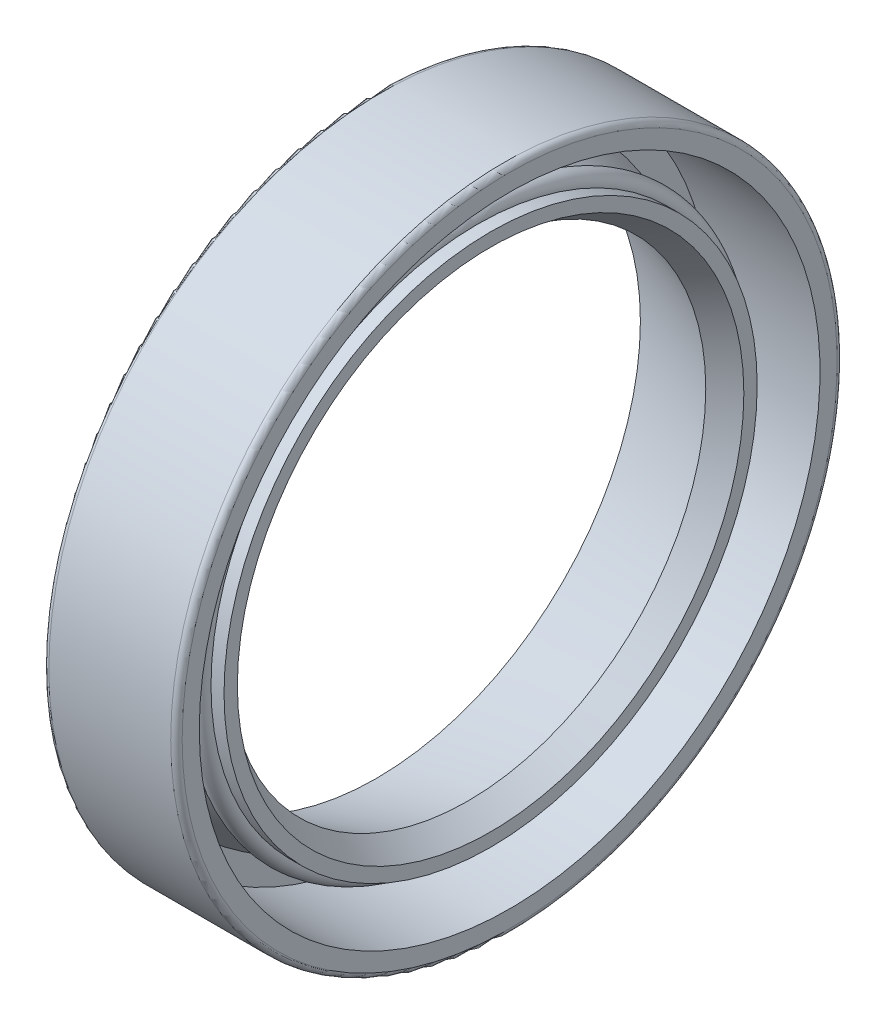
from build123d import *


with BuildPart() as part:
    # Esquisse1 → Base-R_volution (revolve)
    with BuildSketch(Plane(origin=(0, 0, 0), x_dir=(1, 0, 0), z_dir=(0, 1, 0)), mode=Mode.PRIVATE) as base_r_volution_sk:
        with BuildLine():
            Line((0, 13.866666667), (0, 17.2))
            ThreePointArc((0, 17.2), (0.087867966, 17.412132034), (0.3, 17.5))
            Line((0.3, 17.5), (6.7, 17.5))
            ThreePointArc((6.7, 17.5), (6.912132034, 17.412132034), (7, 17.2))
            Line((7, 17.2), (7, 16.3))
            Line((7, 16.3), (1.2, 16.3))
            Line((1.2, 16.3), (1.2, 14.945038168))
            Line((1.2, 14.945038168), (4.275, 14.1))
            ThreePointArc((4.275, 14.1), (4.850230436, 14.622591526), (5.315388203, 14))
            Line((5.315388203, 14), (6, 14))
            Line((6, 14), (6, 13.3))
            Line((6, 13.3), (4.8, 12.5))
            Line((4.8, 12.5), (0, 13.866666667))
        make_face()
    revolve(base_r_volution_sk.sketch.rotate(Axis((0, 0, 0), (1, 0, 0)), 180), axis=Axis((0, 0, 0), (1, 0, 0)))


solid = part.part
